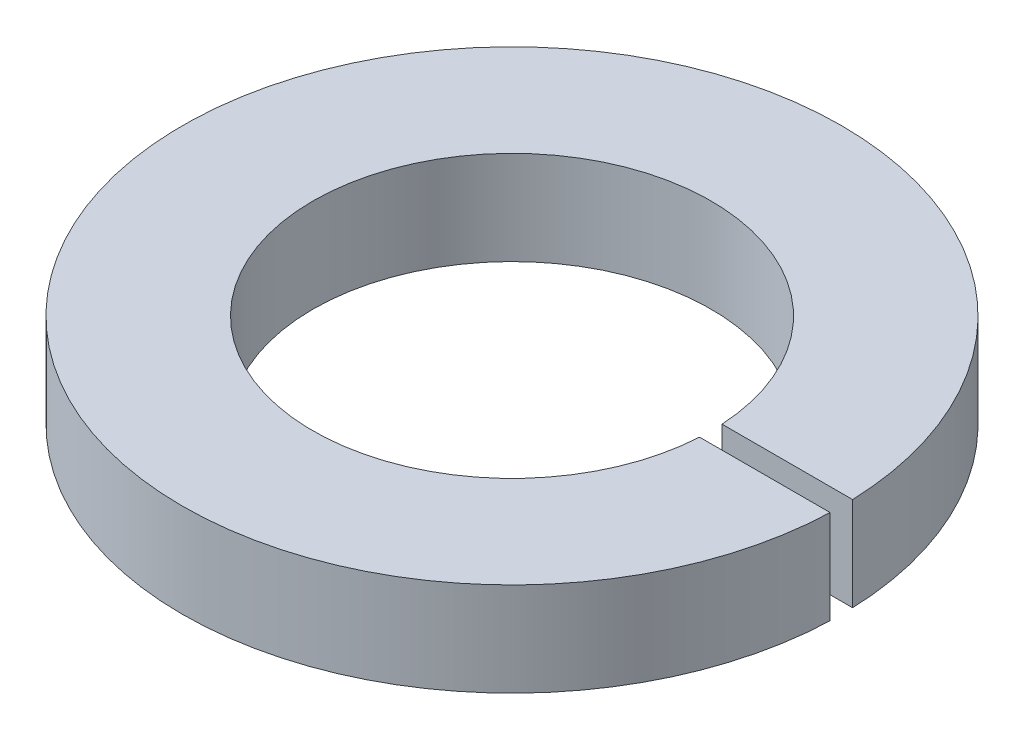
ISO-10303-21;
HEADER;
FILE_DESCRIPTION(('STEP AP214'),'2;1');
FILE_NAME('part.step','',(''),(''),'','','');
FILE_SCHEMA(('AUTOMOTIVE_DESIGN { 1 0 10303 214 1 1 1 1 }'));
ENDSEC;
DATA;
#1=APPLICATION_CONTEXT('core data for automotive mechanical design processes');
#2=APPLICATION_PROTOCOL_DEFINITION('international standard','automotive_design',2000,#1);
#3=PRODUCT_CONTEXT('',#1,'mechanical');
#4=PRODUCT('Part','Part','',(#3));
#5=PRODUCT_RELATED_PRODUCT_CATEGORY('part','',(#4));
#6=PRODUCT_DEFINITION_FORMATION('','',#4);
#7=PRODUCT_DEFINITION_CONTEXT('part definition',#1,'design');
#8=PRODUCT_DEFINITION('design','',#6,#7);
#9=PRODUCT_DEFINITION_SHAPE('','',#8);
#10=(LENGTH_UNIT() NAMED_UNIT(*) SI_UNIT(.MILLI.,.METRE.));
#11=(NAMED_UNIT(*) PLANE_ANGLE_UNIT() SI_UNIT($,.RADIAN.));
#12=(NAMED_UNIT(*) SI_UNIT($,.STERADIAN.) SOLID_ANGLE_UNIT());
#13=UNCERTAINTY_MEASURE_WITH_UNIT(LENGTH_MEASURE(1.E-05),#10,'distance_accuracy_value','');
#14=(GEOMETRIC_REPRESENTATION_CONTEXT(3) GLOBAL_UNCERTAINTY_ASSIGNED_CONTEXT((#13)) GLOBAL_UNIT_ASSIGNED_CONTEXT((#10,
#11,#12)) REPRESENTATION_CONTEXT('',''));
#15=CARTESIAN_POINT('',(0.,0.,0.));
#16=DIRECTION('',(0.,0.,1.));
#17=DIRECTION('',(1.,0.,0.));
#18=AXIS2_PLACEMENT_3D('',#15,#16,#17);
#19=CARTESIAN_POINT('',(0.,3.175,0.));
#20=DIRECTION('',(0.,1.,0.));
#21=DIRECTION('',(0.,0.,1.));
#22=AXIS2_PLACEMENT_3D('',#19,#20,#21);
#23=PLANE('',#22);
#24=CARTESIAN_POINT('',(0.,3.175,0.));
#25=DIRECTION('',(0.,1.,0.));
#26=DIRECTION('',(0.,0.,1.));
#27=AXIS2_PLACEMENT_3D('',#24,#25,#26);
#28=CIRCLE('',#27,11.1633);
#29=CARTESIAN_POINT('',(11.1567963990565,3.175,-0.380999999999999));
#30=VERTEX_POINT('',#29);
#31=CARTESIAN_POINT('',(11.1567963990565,3.175,0.381));
#32=VERTEX_POINT('',#31);
#33=EDGE_CURVE('E83',#30,#32,#28,.T.);
#34=ORIENTED_EDGE('',*,*,#33,.T.);
#35=DIRECTION('',(-1.,0.,0.));
#36=VECTOR('',#35,1.);
#37=CARTESIAN_POINT('',(11.1567963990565,3.175,0.381000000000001));
#38=LINE('',#37,#36);
#39=CARTESIAN_POINT('',(6.73292868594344,3.175,0.381000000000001));
#40=VERTEX_POINT('',#39);
#41=EDGE_CURVE('E86',#32,#40,#38,.T.);
#42=ORIENTED_EDGE('',*,*,#41,.T.);
#43=CARTESIAN_POINT('',(0.,3.175,0.));
#44=DIRECTION('',(0.,1.,0.));
#45=DIRECTION('',(0.,0.,1.));
#46=AXIS2_PLACEMENT_3D('',#43,#44,#45);
#47=CIRCLE('',#46,6.7437);
#48=CARTESIAN_POINT('',(6.73292868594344,3.175,-0.381));
#49=VERTEX_POINT('',#48);
#50=EDGE_CURVE('E85',#49,#40,#47,.T.);
#51=ORIENTED_EDGE('',*,*,#50,.F.);
#52=DIRECTION('',(-1.,0.,0.));
#53=VECTOR('',#52,1.);
#54=CARTESIAN_POINT('',(11.1567963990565,3.175,-0.380999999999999));
#55=LINE('',#54,#53);
#56=EDGE_CURVE('E52',#30,#49,#55,.T.);
#57=ORIENTED_EDGE('',*,*,#56,.F.);
#58=EDGE_LOOP('',(#34,#42,#51,#57));
#59=FACE_BOUND('',#58,.T.);
#60=ADVANCED_FACE('F30',(#59),#23,.T.);
#61=CARTESIAN_POINT('',(0.,0.,0.));
#62=DIRECTION('',(0.,1.,0.));
#63=DIRECTION('',(0.,0.,1.));
#64=AXIS2_PLACEMENT_3D('',#61,#62,#63);
#65=PLANE('',#64);
#66=DIRECTION('',(-1.,0.,0.));
#67=VECTOR('',#66,1.);
#68=CARTESIAN_POINT('',(11.1567963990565,0.,0.381000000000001));
#69=LINE('',#68,#67);
#70=CARTESIAN_POINT('',(11.1567963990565,0.,0.381));
#71=VERTEX_POINT('',#70);
#72=CARTESIAN_POINT('',(6.73292868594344,0.,0.381000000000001));
#73=VERTEX_POINT('',#72);
#74=EDGE_CURVE('E45',#71,#73,#69,.T.);
#75=ORIENTED_EDGE('',*,*,#74,.F.);
#76=CARTESIAN_POINT('',(0.,0.,0.));
#77=DIRECTION('',(0.,1.,0.));
#78=DIRECTION('',(0.,0.,1.));
#79=AXIS2_PLACEMENT_3D('',#76,#77,#78);
#80=CIRCLE('',#79,11.1633);
#81=CARTESIAN_POINT('',(11.1567963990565,0.,-0.380999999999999));
#82=VERTEX_POINT('',#81);
#83=EDGE_CURVE('E89',#82,#71,#80,.T.);
#84=ORIENTED_EDGE('',*,*,#83,.F.);
#85=DIRECTION('',(-1.,0.,0.));
#86=VECTOR('',#85,1.);
#87=CARTESIAN_POINT('',(11.1567963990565,0.,-0.380999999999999));
#88=LINE('',#87,#86);
#89=CARTESIAN_POINT('',(6.73292868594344,0.,-0.381));
#90=VERTEX_POINT('',#89);
#91=EDGE_CURVE('E71',#82,#90,#88,.T.);
#92=ORIENTED_EDGE('',*,*,#91,.T.);
#93=CARTESIAN_POINT('',(0.,0.,0.));
#94=DIRECTION('',(0.,1.,0.));
#95=DIRECTION('',(0.,0.,1.));
#96=AXIS2_PLACEMENT_3D('',#93,#94,#95);
#97=CIRCLE('',#96,6.7437);
#98=EDGE_CURVE('E76',#90,#73,#97,.T.);
#99=ORIENTED_EDGE('',*,*,#98,.T.);
#100=EDGE_LOOP('',(#75,#84,#92,#99));
#101=FACE_BOUND('',#100,.T.);
#102=ADVANCED_FACE('F103',(#101),#65,.F.);
#103=CARTESIAN_POINT('',(0.,3.175,0.));
#104=DIRECTION('',(0.,-1.,0.));
#105=DIRECTION('',(0.,0.,-1.));
#106=AXIS2_PLACEMENT_3D('',#103,#104,#105);
#107=CYLINDRICAL_SURFACE('',#106,11.1633);
#108=DIRECTION('',(0.,1.,0.));
#109=VECTOR('',#108,1.);
#110=CARTESIAN_POINT('',(11.1567963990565,0.,0.381));
#111=LINE('',#110,#109);
#112=EDGE_CURVE('E77',#71,#32,#111,.T.);
#113=ORIENTED_EDGE('',*,*,#112,.T.);
#114=ORIENTED_EDGE('',*,*,#33,.F.);
#115=DIRECTION('',(0.,1.,0.));
#116=VECTOR('',#115,1.);
#117=CARTESIAN_POINT('',(11.1567963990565,0.,-0.380999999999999));
#118=LINE('',#117,#116);
#119=EDGE_CURVE('E68',#82,#30,#118,.T.);
#120=ORIENTED_EDGE('',*,*,#119,.F.);
#121=ORIENTED_EDGE('',*,*,#83,.T.);
#122=EDGE_LOOP('',(#113,#114,#120,#121));
#123=FACE_BOUND('',#122,.T.);
#124=ADVANCED_FACE('F32',(#123),#107,.T.);
#125=CARTESIAN_POINT('',(0.,3.175,0.));
#126=DIRECTION('',(0.,-1.,0.));
#127=DIRECTION('',(0.,0.,-1.));
#128=AXIS2_PLACEMENT_3D('',#125,#126,#127);
#129=CYLINDRICAL_SURFACE('',#128,6.7437);
#130=ORIENTED_EDGE('',*,*,#50,.T.);
#131=DIRECTION('',(0.,-1.,0.));
#132=VECTOR('',#131,1.);
#133=CARTESIAN_POINT('',(6.73292868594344,3.175,0.381000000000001));
#134=LINE('',#133,#132);
#135=EDGE_CURVE('E11',#40,#73,#134,.T.);
#136=ORIENTED_EDGE('',*,*,#135,.T.);
#137=ORIENTED_EDGE('',*,*,#98,.F.);
#138=DIRECTION('',(0.,-1.,0.));
#139=VECTOR('',#138,1.);
#140=CARTESIAN_POINT('',(6.73292868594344,3.175,-0.381));
#141=LINE('',#140,#139);
#142=EDGE_CURVE('E38',#49,#90,#141,.T.);
#143=ORIENTED_EDGE('',*,*,#142,.F.);
#144=EDGE_LOOP('',(#130,#136,#137,#143));
#145=FACE_BOUND('',#144,.T.);
#146=ADVANCED_FACE('F100',(#145),#129,.F.);
#147=CARTESIAN_POINT('',(11.1567963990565,0.,-0.380999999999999));
#148=DIRECTION('',(0.,0.,-1.));
#149=DIRECTION('',(-1.,0.,0.));
#150=AXIS2_PLACEMENT_3D('',#147,#148,#149);
#151=PLANE('',#150);
#152=ORIENTED_EDGE('',*,*,#142,.T.);
#153=ORIENTED_EDGE('',*,*,#91,.F.);
#154=ORIENTED_EDGE('',*,*,#119,.T.);
#155=ORIENTED_EDGE('',*,*,#56,.T.);
#156=EDGE_LOOP('',(#152,#153,#154,#155));
#157=FACE_BOUND('',#156,.T.);
#158=ADVANCED_FACE('F69',(#157),#151,.F.);
#159=CARTESIAN_POINT('',(11.1567963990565,0.,0.381000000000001));
#160=DIRECTION('',(0.,0.,-1.));
#161=DIRECTION('',(-1.,0.,0.));
#162=AXIS2_PLACEMENT_3D('',#159,#160,#161);
#163=PLANE('',#162);
#164=ORIENTED_EDGE('',*,*,#41,.F.);
#165=ORIENTED_EDGE('',*,*,#112,.F.);
#166=ORIENTED_EDGE('',*,*,#74,.T.);
#167=ORIENTED_EDGE('',*,*,#135,.F.);
#168=EDGE_LOOP('',(#164,#165,#166,#167));
#169=FACE_BOUND('',#168,.T.);
#170=ADVANCED_FACE('F113',(#169),#163,.T.);
#171=CLOSED_SHELL('',(#60,#102,#124,#146,#158,#170));
#172=MANIFOLD_SOLID_BREP('B2',#171);
#173=ADVANCED_BREP_SHAPE_REPRESENTATION('',(#18,#172),#14);
#174=SHAPE_DEFINITION_REPRESENTATION(#9,#173);
ENDSEC;
END-ISO-10303-21;
